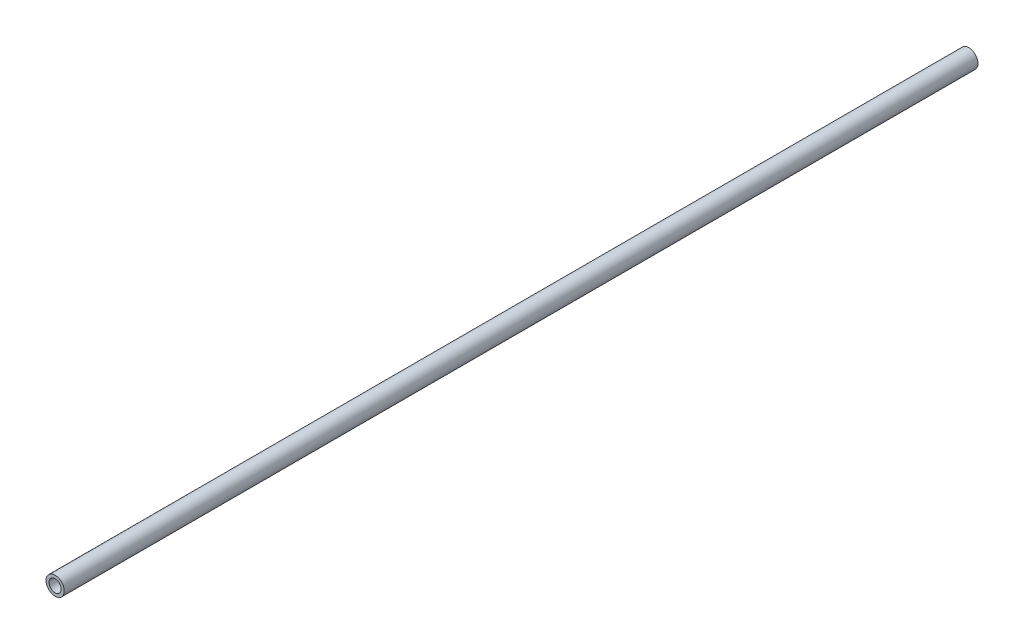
from build123d import *

# Parameters (mm, degrees)
SZKIC1_R                    = 3
SZKIC1_R_2                  = 2
DODANIE_WYCI_GNI_CIE1_DEPTH = 300


with BuildPart() as part:
    # Szkic1 → Dodanie-wyci_gni_cie1 (new body)
    with BuildSketch(Plane.XY):
        Circle(SZKIC1_R)
        Circle(SZKIC1_R_2, mode=Mode.SUBTRACT)
    extrude(amount=DODANIE_WYCI_GNI_CIE1_DEPTH)


solid = part.part
